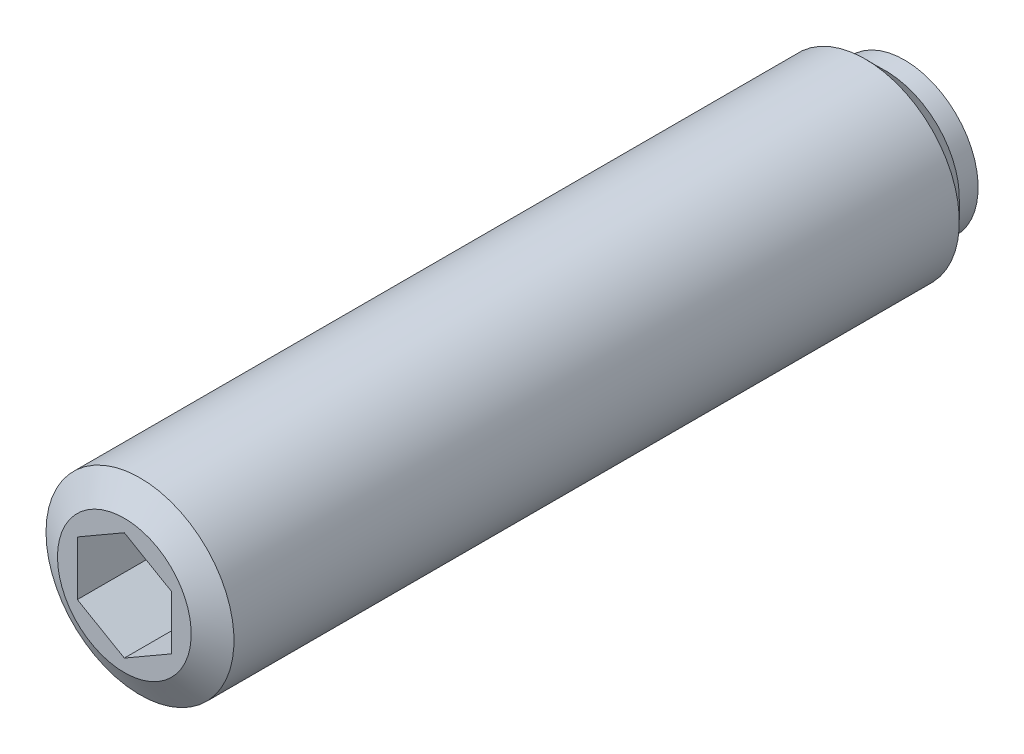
ISO-10303-21;
HEADER;
FILE_DESCRIPTION(('STEP AP214'),'2;1');
FILE_NAME('part.step','',(''),(''),'','','');
FILE_SCHEMA(('AUTOMOTIVE_DESIGN { 1 0 10303 214 1 1 1 1 }'));
ENDSEC;
DATA;
#1=APPLICATION_CONTEXT('core data for automotive mechanical design processes');
#2=APPLICATION_PROTOCOL_DEFINITION('international standard','automotive_design',2000,#1);
#3=PRODUCT_CONTEXT('',#1,'mechanical');
#4=PRODUCT('Part','Part','',(#3));
#5=PRODUCT_RELATED_PRODUCT_CATEGORY('part','',(#4));
#6=PRODUCT_DEFINITION_FORMATION('','',#4);
#7=PRODUCT_DEFINITION_CONTEXT('part definition',#1,'design');
#8=PRODUCT_DEFINITION('design','',#6,#7);
#9=PRODUCT_DEFINITION_SHAPE('','',#8);
#10=(LENGTH_UNIT() NAMED_UNIT(*) SI_UNIT(.MILLI.,.METRE.));
#11=(NAMED_UNIT(*) PLANE_ANGLE_UNIT() SI_UNIT($,.RADIAN.));
#12=(NAMED_UNIT(*) SI_UNIT($,.STERADIAN.) SOLID_ANGLE_UNIT());
#13=UNCERTAINTY_MEASURE_WITH_UNIT(LENGTH_MEASURE(1.E-05),#10,'distance_accuracy_value','');
#14=(GEOMETRIC_REPRESENTATION_CONTEXT(3) GLOBAL_UNCERTAINTY_ASSIGNED_CONTEXT((#13)) GLOBAL_UNIT_ASSIGNED_CONTEXT((#10,
#11,#12)) REPRESENTATION_CONTEXT('',''));
#15=CARTESIAN_POINT('',(0.,0.,0.));
#16=DIRECTION('',(0.,0.,1.));
#17=DIRECTION('',(1.,0.,0.));
#18=AXIS2_PLACEMENT_3D('',#15,#16,#17);
#19=CARTESIAN_POINT('',(0.,1.50253119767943,0.));
#20=DIRECTION('',(0.,0.,1.));
#21=DIRECTION('',(-1.,0.,0.));
#22=AXIS2_PLACEMENT_3D('',#19,#20,#21);
#23=PLANE('',#22);
#24=CARTESIAN_POINT('',(0.,0.,0.));
#25=DIRECTION('',(0.,0.,1.));
#26=DIRECTION('',(-1.,0.,0.));
#27=AXIS2_PLACEMENT_3D('',#24,#25,#26);
#28=CIRCLE('',#27,1.50253119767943);
#29=CARTESIAN_POINT('',(0.,1.50253119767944,0.));
#30=VERTEX_POINT('',#29);
#31=EDGE_CURVE('E9',#30,#30,#28,.T.);
#32=ORIENTED_EDGE('',*,*,#31,.F.);
#33=EDGE_LOOP('',(#32));
#34=FACE_BOUND('',#33,.T.);
#35=ADVANCED_FACE('F14',(#34),#23,.F.);
#36=CARTESIAN_POINT('',(0.,0.,1.32));
#37=DIRECTION('',(0.,0.,1.));
#38=DIRECTION('',(0.,1.,0.));
#39=AXIS2_PLACEMENT_3D('',#36,#37,#38);
#40=SPHERICAL_SURFACE('',#39,2.);
#41=CARTESIAN_POINT('',(0.,0.,0.4));
#42=DIRECTION('',(0.,0.,1.));
#43=DIRECTION('',(-1.,0.,0.));
#44=AXIS2_PLACEMENT_3D('',#41,#42,#43);
#45=CIRCLE('',#44,1.77583783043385);
#46=CARTESIAN_POINT('',(0.,1.77583783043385,0.4));
#47=VERTEX_POINT('',#46);
#48=EDGE_CURVE('E21',#47,#47,#45,.T.);
#49=CARTESIAN_POINT('',(0.,1.77583783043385,0.4));
#50=CARTESIAN_POINT('',(0.,1.77351077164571,0.395508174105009));
#51=CARTESIAN_POINT('',(0.,1.77116666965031,0.391025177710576));
#52=CARTESIAN_POINT('',(0.,1.76644451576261,0.382077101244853));
#53=CARTESIAN_POINT('',(0.,1.76406646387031,0.377612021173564));
#54=CARTESIAN_POINT('',(0.,1.75927654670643,0.368700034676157));
#55=CARTESIAN_POINT('',(0.,1.75686468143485,0.36425312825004));
#56=CARTESIAN_POINT('',(0.,1.75200727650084,0.355377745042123));
#57=CARTESIAN_POINT('',(0.,1.74956173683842,0.350949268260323));
#58=CARTESIAN_POINT('',(0.,1.74463712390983,0.342110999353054));
#59=CARTESIAN_POINT('',(0.,1.74215805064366,0.337701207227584));
#60=CARTESIAN_POINT('',(0.,1.73716651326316,0.328900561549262));
#61=CARTESIAN_POINT('',(0.,1.73465404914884,0.324509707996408));
#62=CARTESIAN_POINT('',(0.,1.72959587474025,0.315747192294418));
#63=CARTESIAN_POINT('',(0.,1.72705016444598,0.311375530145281));
#64=CARTESIAN_POINT('',(0.,1.72192564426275,0.302651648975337));
#65=CARTESIAN_POINT('',(0.,1.71934683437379,0.29829942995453));
#66=CARTESIAN_POINT('',(0.,1.71415626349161,0.289614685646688));
#67=CARTESIAN_POINT('',(0.,1.71154450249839,0.285282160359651));
#68=CARTESIAN_POINT('',(0.,1.7062881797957,0.276637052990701));
#69=CARTESIAN_POINT('',(0.,1.70364361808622,0.272324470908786));
#70=CARTESIAN_POINT('',(0.,1.69832184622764,0.263719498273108));
#71=CARTESIAN_POINT('',(0.,1.69564463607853,0.259427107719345));
#72=CARTESIAN_POINT('',(0.,1.69025772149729,0.250862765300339));
#73=CARTESIAN_POINT('',(0.,1.68754801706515,0.246590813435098));
#74=CARTESIAN_POINT('',(0.,1.68209626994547,0.238067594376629));
#75=CARTESIAN_POINT('',(0.,1.67935422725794,0.233816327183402));
#76=CARTESIAN_POINT('',(0.,1.67383796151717,0.225334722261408));
#77=CARTESIAN_POINT('',(0.,1.67106373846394,0.221104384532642));
#78=CARTESIAN_POINT('',(0.,1.66548327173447,0.212664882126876));
#79=CARTESIAN_POINT('',(0.,1.66267702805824,0.208455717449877));
#80=CARTESIAN_POINT('',(0.,1.65703268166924,0.200058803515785));
#81=CARTESIAN_POINT('',(0.,1.65419457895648,0.195871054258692));
#82=CARTESIAN_POINT('',(0.,1.64848667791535,0.18751721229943));
#83=CARTESIAN_POINT('',(0.,1.645616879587,0.18335111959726));
#84=CARTESIAN_POINT('',(0.,1.63984575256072,0.175040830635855));
#85=CARTESIAN_POINT('',(0.,1.63694442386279,0.170896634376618));
#86=CARTESIAN_POINT('',(0.,1.63111040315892,0.162630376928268));
#87=CARTESIAN_POINT('',(0.,1.62817771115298,0.158508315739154));
#88=CARTESIAN_POINT('',(0.,1.62228113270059,0.150286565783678));
#89=CARTESIAN_POINT('',(0.,1.61931724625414,0.146186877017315));
#90=CARTESIAN_POINT('',(0.,1.61335844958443,0.138010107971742));
#91=CARTESIAN_POINT('',(0.,1.61036353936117,0.133933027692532));
#92=CARTESIAN_POINT('',(0.,1.60434286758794,0.125801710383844));
#93=CARTESIAN_POINT('',(0.,1.60131710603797,0.121747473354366));
#94=CARTESIAN_POINT('',(0.,1.59523490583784,0.113662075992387));
#95=CARTESIAN_POINT('',(0.,1.59217846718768,0.109630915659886));
#96=CARTESIAN_POINT('',(0.,1.58603508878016,0.101591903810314));
#97=CARTESIAN_POINT('',(0.,1.58294814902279,0.0975840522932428));
#98=CARTESIAN_POINT('',(0.,1.57674394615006,0.0895918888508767));
#99=CARTESIAN_POINT('',(0.,1.57362668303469,0.0856075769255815));
#100=CARTESIAN_POINT('',(0.,1.56736201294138,0.0776627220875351));
#101=CARTESIAN_POINT('',(0.,1.56421460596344,0.0737021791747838));
#102=CARTESIAN_POINT('',(0.,1.55788982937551,0.0658050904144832));
#103=CARTESIAN_POINT('',(0.,1.55471245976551,0.0618685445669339));
#104=CARTESIAN_POINT('',(0.,1.54832794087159,0.0540196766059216));
#105=CARTESIAN_POINT('',(0.,1.54512079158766,0.0501073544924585));
#106=CARTESIAN_POINT('',(0.,1.53867689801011,0.0423071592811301));
#107=CARTESIAN_POINT('',(0.,1.53544015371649,0.0384192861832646));
#108=CARTESIAN_POINT('',(0.,1.52893725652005,0.0306682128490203));
#109=CARTESIAN_POINT('',(0.,1.52567110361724,0.0268050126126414));
#110=CARTESIAN_POINT('',(0.,1.5191095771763,0.019103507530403));
#111=CARTESIAN_POINT('',(0.,1.51581420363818,0.0152652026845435));
#112=CARTESIAN_POINT('',(0.,1.50919442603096,0.00761370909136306));
#113=CARTESIAN_POINT('',(0.,1.50587002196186,0.00380052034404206));
#114=CARTESIAN_POINT('',(0.,1.50253119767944,0.));
#115=B_SPLINE_CURVE_WITH_KNOTS('',3,(#49,#50,#51,#52,#53,#54,#55,#56,#57,#58,#59,#60,#61,#62,
#63,#64,#65,#66,#67,#68,#69,#70,#71,#72,#73,#74,#75,#76,#77,#78,#79,#80,#81,#82,#83,#84,#85,#86,
#87,#88,#89,#90,#91,#92,#93,#94,#95,#96,#97,#98,#99,#100,#101,#102,#103,#104,#105,#106,#107,
#108,#109,#110,#111,#112,#113,#114),.UNSPECIFIED.,.F.,.F.,(4,2,2,2,2,2,2,2,2,2,2,2,2,2,2,2,2,2,
2,2,2,2,2,2,2,2,2,2,2,2,2,2,4),(0.,0.0151764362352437,0.0303528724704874,0.0455293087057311,
0.0607057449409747,0.0758821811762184,0.0910586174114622,0.106235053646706,0.121411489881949,
0.136587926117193,0.151764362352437,0.16694079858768,0.182117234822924,0.197293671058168,
0.212470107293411,0.227646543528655,0.242822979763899,0.257999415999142,0.273175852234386,
0.28835228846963,0.303528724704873,0.318705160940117,0.33388159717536,0.349058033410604,
0.364234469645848,0.379410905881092,0.394587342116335,0.409763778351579,0.424940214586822,
0.440116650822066,0.45529308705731,0.470469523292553,0.485645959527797),.UNSPECIFIED.);
#116=EDGE_CURVE('BSEAM141',#47,#30,#115,.T.);
#117=ORIENTED_EDGE('',*,*,#48,.F.);
#118=ORIENTED_EDGE('',*,*,#31,.T.);
#119=ORIENTED_EDGE('',*,*,#116,.T.);
#120=ORIENTED_EDGE('',*,*,#116,.F.);
#121=EDGE_LOOP('',(#117,#119,#118,#120));
#122=FACE_BOUND('',#121,.T.);
#123=ADVANCED_FACE('F141',(#122),#40,.T.);
#124=CARTESIAN_POINT('',(0.,2.35,0.4));
#125=DIRECTION('',(0.,0.,1.));
#126=DIRECTION('',(-1.,0.,0.));
#127=AXIS2_PLACEMENT_3D('',#124,#125,#126);
#128=PLANE('',#127);
#129=CARTESIAN_POINT('',(0.,0.,0.4));
#130=DIRECTION('',(0.,0.,1.));
#131=DIRECTION('',(-1.,0.,0.));
#132=AXIS2_PLACEMENT_3D('',#129,#130,#131);
#133=CIRCLE('',#132,2.35);
#134=CARTESIAN_POINT('',(-2.35,0.,0.4));
#135=VERTEX_POINT('',#134);
#136=EDGE_CURVE('E134',#135,#135,#133,.T.);
#137=ORIENTED_EDGE('',*,*,#136,.F.);
#138=EDGE_LOOP('',(#137));
#139=FACE_BOUND('',#138,.T.);
#140=ORIENTED_EDGE('',*,*,#48,.T.);
#141=EDGE_LOOP('',(#140));
#142=FACE_BOUND('',#141,.T.);
#143=ADVANCED_FACE('F139',(#139,#142),#128,.F.);
#144=CARTESIAN_POINT('',(0.,0.,26.6950749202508));
#145=DIRECTION('',(0.,0.,1.));
#146=DIRECTION('',(-1.,0.,0.));
#147=AXIS2_PLACEMENT_3D('',#144,#145,#146);
#148=CYLINDRICAL_SURFACE('',#147,2.35);
#149=CARTESIAN_POINT('',(0.,0.,1.));
#150=DIRECTION('',(0.,0.,1.));
#151=DIRECTION('',(-1.,0.,0.));
#152=AXIS2_PLACEMENT_3D('',#149,#150,#151);
#153=CIRCLE('',#152,2.35);
#154=CARTESIAN_POINT('',(-2.35,0.,1.));
#155=VERTEX_POINT('',#154);
#156=EDGE_CURVE('E131',#155,#155,#153,.T.);
#157=ORIENTED_EDGE('',*,*,#156,.F.);
#158=EDGE_LOOP('',(#157));
#159=FACE_BOUND('',#158,.T.);
#160=ORIENTED_EDGE('',*,*,#136,.T.);
#161=EDGE_LOOP('',(#160));
#162=FACE_BOUND('',#161,.T.);
#163=ADVANCED_FACE('F164',(#159,#162),#148,.T.);
#164=CARTESIAN_POINT('',(0.,0.,1.));
#165=DIRECTION('',(0.,0.,1.));
#166=DIRECTION('',(-1.,0.,0.));
#167=AXIS2_PLACEMENT_3D('',#164,#165,#166);
#168=CONICAL_SURFACE('',#167,2.35,0.785398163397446);
#169=CARTESIAN_POINT('',(0.,0.,1.65));
#170=DIRECTION('',(0.,0.,1.));
#171=DIRECTION('',(-1.,0.,0.));
#172=AXIS2_PLACEMENT_3D('',#169,#170,#171);
#173=CIRCLE('',#172,3.);
#174=CARTESIAN_POINT('',(-3.,0.,1.65));
#175=VERTEX_POINT('',#174);
#176=EDGE_CURVE('E128',#175,#175,#173,.T.);
#177=ORIENTED_EDGE('',*,*,#176,.F.);
#178=EDGE_LOOP('',(#177));
#179=FACE_BOUND('',#178,.T.);
#180=ORIENTED_EDGE('',*,*,#156,.T.);
#181=EDGE_LOOP('',(#180));
#182=FACE_BOUND('',#181,.T.);
#183=ADVANCED_FACE('F173',(#179,#182),#168,.T.);
#184=CARTESIAN_POINT('',(0.,0.,26.6950749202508));
#185=DIRECTION('',(0.,0.,1.));
#186=DIRECTION('',(-1.,0.,0.));
#187=AXIS2_PLACEMENT_3D('',#184,#185,#186);
#188=CYLINDRICAL_SURFACE('',#187,3.);
#189=CARTESIAN_POINT('',(0.,0.,24.8));
#190=DIRECTION('',(0.,0.,1.));
#191=DIRECTION('',(-1.,0.,0.));
#192=AXIS2_PLACEMENT_3D('',#189,#190,#191);
#193=CIRCLE('',#192,3.);
#194=CARTESIAN_POINT('',(-3.,0.,24.8));
#195=VERTEX_POINT('',#194);
#196=EDGE_CURVE('E125',#195,#195,#193,.T.);
#197=ORIENTED_EDGE('',*,*,#196,.F.);
#198=EDGE_LOOP('',(#197));
#199=FACE_BOUND('',#198,.T.);
#200=ORIENTED_EDGE('',*,*,#176,.T.);
#201=EDGE_LOOP('',(#200));
#202=FACE_BOUND('',#201,.T.);
#203=ADVANCED_FACE('F182',(#199,#202),#188,.T.);
#204=CARTESIAN_POINT('',(0.,0.,24.8));
#205=DIRECTION('',(0.,0.,-1.));
#206=DIRECTION('',(1.,0.,0.));
#207=AXIS2_PLACEMENT_3D('',#204,#205,#206);
#208=CONICAL_SURFACE('',#207,3.,1.04719755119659);
#209=CARTESIAN_POINT('',(0.,0.,25.3));
#210=DIRECTION('',(0.,0.,1.));
#211=DIRECTION('',(-1.,0.,0.));
#212=AXIS2_PLACEMENT_3D('',#209,#210,#211);
#213=CIRCLE('',#212,2.13397459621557);
#214=CARTESIAN_POINT('',(-2.13397459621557,0.,25.3));
#215=VERTEX_POINT('',#214);
#216=EDGE_CURVE('E116',#215,#215,#213,.T.);
#217=ORIENTED_EDGE('',*,*,#216,.F.);
#218=EDGE_LOOP('',(#217));
#219=FACE_BOUND('',#218,.T.);
#220=ORIENTED_EDGE('',*,*,#196,.T.);
#221=EDGE_LOOP('',(#220));
#222=FACE_BOUND('',#221,.T.);
#223=ADVANCED_FACE('F191',(#219,#222),#208,.T.);
#224=CARTESIAN_POINT('',(0.,0.,25.3));
#225=DIRECTION('',(0.,0.,-1.));
#226=DIRECTION('',(1.,0.,0.));
#227=AXIS2_PLACEMENT_3D('',#224,#225,#226);
#228=PLANE('',#227);
#229=DIRECTION('',(-0.866025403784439,-0.5,0.));
#230=VECTOR('',#229,1.);
#231=CARTESIAN_POINT('',(0.,1.73205080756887,25.3));
#232=LINE('',#231,#230);
#233=CARTESIAN_POINT('',(0.,1.73205080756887,25.3));
#234=VERTEX_POINT('',#233);
#235=CARTESIAN_POINT('',(-1.5,0.866025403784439,25.3));
#236=VERTEX_POINT('',#235);
#237=EDGE_CURVE('E82',#234,#236,#232,.T.);
#238=ORIENTED_EDGE('',*,*,#237,.F.);
#239=DIRECTION('',(-0.866025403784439,0.5,0.));
#240=VECTOR('',#239,1.);
#241=CARTESIAN_POINT('',(1.5,0.866025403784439,25.3));
#242=LINE('',#241,#240);
#243=CARTESIAN_POINT('',(1.5,0.866025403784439,25.3));
#244=VERTEX_POINT('',#243);
#245=EDGE_CURVE('E28',#244,#234,#242,.T.);
#246=ORIENTED_EDGE('',*,*,#245,.F.);
#247=DIRECTION('',(0.,1.,0.));
#248=VECTOR('',#247,1.);
#249=CARTESIAN_POINT('',(1.5,-0.866025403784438,25.3));
#250=LINE('',#249,#248);
#251=CARTESIAN_POINT('',(1.5,-0.866025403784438,25.3));
#252=VERTEX_POINT('',#251);
#253=EDGE_CURVE('E98',#252,#244,#250,.T.);
#254=ORIENTED_EDGE('',*,*,#253,.F.);
#255=DIRECTION('',(0.866025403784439,0.5,0.));
#256=VECTOR('',#255,1.);
#257=CARTESIAN_POINT('',(0.,-1.73205080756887,25.3));
#258=LINE('',#257,#256);
#259=CARTESIAN_POINT('',(0.,-1.73205080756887,25.3));
#260=VERTEX_POINT('',#259);
#261=EDGE_CURVE('E92',#260,#252,#258,.T.);
#262=ORIENTED_EDGE('',*,*,#261,.F.);
#263=DIRECTION('',(0.866025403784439,-0.5,0.));
#264=VECTOR('',#263,1.);
#265=CARTESIAN_POINT('',(-1.5,-0.866025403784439,25.3));
#266=LINE('',#265,#264);
#267=CARTESIAN_POINT('',(-1.5,-0.866025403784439,25.3));
#268=VERTEX_POINT('',#267);
#269=EDGE_CURVE('E90',#268,#260,#266,.T.);
#270=ORIENTED_EDGE('',*,*,#269,.F.);
#271=DIRECTION('',(0.,-1.,0.));
#272=VECTOR('',#271,1.);
#273=CARTESIAN_POINT('',(-1.5,0.866025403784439,25.3));
#274=LINE('',#273,#272);
#275=EDGE_CURVE('E71',#236,#268,#274,.T.);
#276=ORIENTED_EDGE('',*,*,#275,.F.);
#277=EDGE_LOOP('',(#238,#246,#254,#262,#270,#276));
#278=FACE_BOUND('',#277,.T.);
#279=ORIENTED_EDGE('',*,*,#216,.T.);
#280=EDGE_LOOP('',(#279));
#281=FACE_BOUND('',#280,.T.);
#282=ADVANCED_FACE('F86',(#278,#281),#228,.F.);
#283=CARTESIAN_POINT('',(1.5,0.866025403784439,22.3));
#284=DIRECTION('',(0.5,0.866025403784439,0.));
#285=DIRECTION('',(0.866025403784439,-0.5,0.));
#286=AXIS2_PLACEMENT_3D('',#283,#284,#285);
#287=PLANE('',#286);
#288=ORIENTED_EDGE('',*,*,#245,.T.);
#289=DIRECTION('',(0.,0.,1.));
#290=VECTOR('',#289,1.);
#291=CARTESIAN_POINT('',(0.,1.73205080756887,22.3));
#292=LINE('',#291,#290);
#293=CARTESIAN_POINT('',(0.,1.73205080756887,22.3));
#294=VERTEX_POINT('',#293);
#295=EDGE_CURVE('E79',#294,#234,#292,.T.);
#296=ORIENTED_EDGE('',*,*,#295,.F.);
#297=DIRECTION('',(-0.866025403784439,0.5,0.));
#298=VECTOR('',#297,1.);
#299=CARTESIAN_POINT('',(1.5,0.866025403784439,22.3));
#300=LINE('',#299,#298);
#301=CARTESIAN_POINT('',(1.5,0.866025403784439,22.3));
#302=VERTEX_POINT('',#301);
#303=EDGE_CURVE('E100',#302,#294,#300,.T.);
#304=ORIENTED_EDGE('',*,*,#303,.F.);
#305=DIRECTION('',(0.,0.,1.));
#306=VECTOR('',#305,1.);
#307=CARTESIAN_POINT('',(1.5,0.866025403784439,22.3));
#308=LINE('',#307,#306);
#309=EDGE_CURVE('E35',#302,#244,#308,.T.);
#310=ORIENTED_EDGE('',*,*,#309,.T.);
#311=EDGE_LOOP('',(#288,#296,#304,#310));
#312=FACE_BOUND('',#311,.T.);
#313=ADVANCED_FACE('F208',(#312),#287,.F.);
#314=CARTESIAN_POINT('',(1.5,-0.866025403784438,22.3));
#315=DIRECTION('',(1.,0.,0.));
#316=DIRECTION('',(0.,-1.,0.));
#317=AXIS2_PLACEMENT_3D('',#314,#315,#316);
#318=PLANE('',#317);
#319=ORIENTED_EDGE('',*,*,#253,.T.);
#320=ORIENTED_EDGE('',*,*,#309,.F.);
#321=DIRECTION('',(0.,1.,0.));
#322=VECTOR('',#321,1.);
#323=CARTESIAN_POINT('',(1.5,-0.866025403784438,22.3));
#324=LINE('',#323,#322);
#325=CARTESIAN_POINT('',(1.5,-0.866025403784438,22.3));
#326=VERTEX_POINT('',#325);
#327=EDGE_CURVE('E112',#326,#302,#324,.T.);
#328=ORIENTED_EDGE('',*,*,#327,.F.);
#329=DIRECTION('',(0.,0.,1.));
#330=VECTOR('',#329,1.);
#331=CARTESIAN_POINT('',(1.5,-0.866025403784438,22.3));
#332=LINE('',#331,#330);
#333=EDGE_CURVE('E117',#326,#252,#332,.T.);
#334=ORIENTED_EDGE('',*,*,#333,.T.);
#335=EDGE_LOOP('',(#319,#320,#328,#334));
#336=FACE_BOUND('',#335,.T.);
#337=ADVANCED_FACE('F216',(#336),#318,.F.);
#338=CARTESIAN_POINT('',(0.,-1.73205080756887,22.3));
#339=DIRECTION('',(0.5,-0.866025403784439,0.));
#340=DIRECTION('',(-0.866025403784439,-0.5,0.));
#341=AXIS2_PLACEMENT_3D('',#338,#339,#340);
#342=PLANE('',#341);
#343=ORIENTED_EDGE('',*,*,#261,.T.);
#344=ORIENTED_EDGE('',*,*,#333,.F.);
#345=DIRECTION('',(0.866025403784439,0.5,0.));
#346=VECTOR('',#345,1.);
#347=CARTESIAN_POINT('',(0.,-1.73205080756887,22.3));
#348=LINE('',#347,#346);
#349=CARTESIAN_POINT('',(0.,-1.73205080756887,22.3));
#350=VERTEX_POINT('',#349);
#351=EDGE_CURVE('E109',#350,#326,#348,.T.);
#352=ORIENTED_EDGE('',*,*,#351,.F.);
#353=DIRECTION('',(0.,0.,1.));
#354=VECTOR('',#353,1.);
#355=CARTESIAN_POINT('',(0.,-1.73205080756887,22.3));
#356=LINE('',#355,#354);
#357=EDGE_CURVE('E119',#350,#260,#356,.T.);
#358=ORIENTED_EDGE('',*,*,#357,.T.);
#359=EDGE_LOOP('',(#343,#344,#352,#358));
#360=FACE_BOUND('',#359,.T.);
#361=ADVANCED_FACE('F224',(#360),#342,.F.);
#362=CARTESIAN_POINT('',(-1.5,-0.866025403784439,22.3));
#363=DIRECTION('',(-0.5,-0.866025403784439,0.));
#364=DIRECTION('',(-0.866025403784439,0.5,0.));
#365=AXIS2_PLACEMENT_3D('',#362,#363,#364);
#366=PLANE('',#365);
#367=ORIENTED_EDGE('',*,*,#269,.T.);
#368=ORIENTED_EDGE('',*,*,#357,.F.);
#369=DIRECTION('',(0.866025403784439,-0.5,0.));
#370=VECTOR('',#369,1.);
#371=CARTESIAN_POINT('',(-1.5,-0.866025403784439,22.3));
#372=LINE('',#371,#370);
#373=CARTESIAN_POINT('',(-1.5,-0.866025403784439,22.3));
#374=VERTEX_POINT('',#373);
#375=EDGE_CURVE('E106',#374,#350,#372,.T.);
#376=ORIENTED_EDGE('',*,*,#375,.F.);
#377=DIRECTION('',(0.,0.,1.));
#378=VECTOR('',#377,1.);
#379=CARTESIAN_POINT('',(-1.5,-0.866025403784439,22.3));
#380=LINE('',#379,#378);
#381=EDGE_CURVE('E78',#374,#268,#380,.T.);
#382=ORIENTED_EDGE('',*,*,#381,.T.);
#383=EDGE_LOOP('',(#367,#368,#376,#382));
#384=FACE_BOUND('',#383,.T.);
#385=ADVANCED_FACE('F232',(#384),#366,.F.);
#386=CARTESIAN_POINT('',(-1.5,0.866025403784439,22.3));
#387=DIRECTION('',(-1.,0.,0.));
#388=DIRECTION('',(0.,1.,0.));
#389=AXIS2_PLACEMENT_3D('',#386,#387,#388);
#390=PLANE('',#389);
#391=ORIENTED_EDGE('',*,*,#275,.T.);
#392=ORIENTED_EDGE('',*,*,#381,.F.);
#393=DIRECTION('',(0.,-1.,0.));
#394=VECTOR('',#393,1.);
#395=CARTESIAN_POINT('',(-1.5,0.866025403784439,22.3));
#396=LINE('',#395,#394);
#397=CARTESIAN_POINT('',(-1.5,0.866025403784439,22.3));
#398=VERTEX_POINT('',#397);
#399=EDGE_CURVE('E74',#398,#374,#396,.T.);
#400=ORIENTED_EDGE('',*,*,#399,.F.);
#401=DIRECTION('',(0.,0.,1.));
#402=VECTOR('',#401,1.);
#403=CARTESIAN_POINT('',(-1.5,0.866025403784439,22.3));
#404=LINE('',#403,#402);
#405=EDGE_CURVE('E67',#398,#236,#404,.T.);
#406=ORIENTED_EDGE('',*,*,#405,.T.);
#407=EDGE_LOOP('',(#391,#392,#400,#406));
#408=FACE_BOUND('',#407,.T.);
#409=ADVANCED_FACE('F69',(#408),#390,.F.);
#410=CARTESIAN_POINT('',(0.,1.73205080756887,22.3));
#411=DIRECTION('',(-0.5,0.866025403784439,0.));
#412=DIRECTION('',(0.866025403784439,0.5,0.));
#413=AXIS2_PLACEMENT_3D('',#410,#411,#412);
#414=PLANE('',#413);
#415=ORIENTED_EDGE('',*,*,#237,.T.);
#416=ORIENTED_EDGE('',*,*,#405,.F.);
#417=DIRECTION('',(-0.866025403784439,-0.5,0.));
#418=VECTOR('',#417,1.);
#419=CARTESIAN_POINT('',(0.,1.73205080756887,22.3));
#420=LINE('',#419,#418);
#421=EDGE_CURVE('E103',#294,#398,#420,.T.);
#422=ORIENTED_EDGE('',*,*,#421,.F.);
#423=ORIENTED_EDGE('',*,*,#295,.T.);
#424=EDGE_LOOP('',(#415,#416,#422,#423));
#425=FACE_BOUND('',#424,.T.);
#426=ADVANCED_FACE('F83',(#425),#414,.F.);
#427=CARTESIAN_POINT('',(3.,0.,22.3));
#428=DIRECTION('',(0.,0.,-1.));
#429=DIRECTION('',(1.,0.,0.));
#430=AXIS2_PLACEMENT_3D('',#427,#428,#429);
#431=PLANE('',#430);
#432=ORIENTED_EDGE('',*,*,#303,.T.);
#433=ORIENTED_EDGE('',*,*,#421,.T.);
#434=ORIENTED_EDGE('',*,*,#399,.T.);
#435=ORIENTED_EDGE('',*,*,#375,.T.);
#436=ORIENTED_EDGE('',*,*,#351,.T.);
#437=ORIENTED_EDGE('',*,*,#327,.T.);
#438=EDGE_LOOP('',(#432,#433,#434,#435,#436,#437));
#439=FACE_BOUND('',#438,.T.);
#440=ADVANCED_FACE('F256',(#439),#431,.F.);
#441=CLOSED_SHELL('',(#35,#123,#143,#163,#183,#203,#223,#282,#313,#337,#361,#385,#409,#426,#440));
#442=MANIFOLD_SOLID_BREP('B1',#441);
#443=ADVANCED_BREP_SHAPE_REPRESENTATION('',(#18,#442),#14);
#444=SHAPE_DEFINITION_REPRESENTATION(#9,#443);
ENDSEC;
END-ISO-10303-21;
